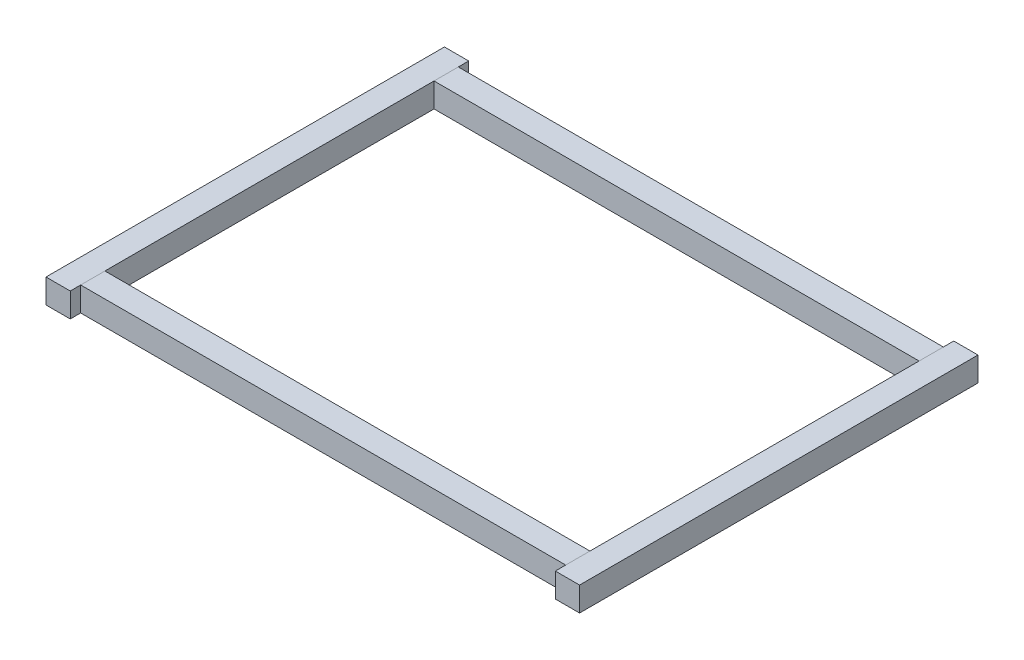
from build123d import *

# Parameters (mm, degrees)
ESQUISSE1_W          = 14
ESQUISSE1_H          = 14
BOSS_EXTRU_1_DEPTH   = 230
BOSS_EXTRU_1_2_DEPTH = 230
BOSS_EXTRU_2_REACH   = 375.54
ESQUISSE2_W          = 14
ESQUISSE2_H          = 14


with BuildPart() as part:
    # Esquisse1 → Boss.-Extru.1 (new body)
    with BuildSketch(Plane.XY):
        with Locations((287, 7)):
            Rectangle(ESQUISSE1_W, ESQUISSE1_H)
    extrude(amount=BOSS_EXTRU_1_DEPTH)


with BuildPart() as body_2:
    # Esquisse1 → Boss.-Extru.1 2 (new body)
    with BuildSketch(Plane.XY):
        with Locations((-7, 7)):
            Rectangle(ESQUISSE1_W, ESQUISSE1_H)
    extrude(amount=BOSS_EXTRU_1_2_DEPTH)


with BuildPart() as body_3:

    # Esquisse2 → Boss.-Extru.2 (new, up to next)
    with BuildSketch(Plane(origin=(0, 0, 0), x_dir=(0, 0, -1), z_dir=(1, 0, 0)), mode=Mode.PRIVATE) as boss_extru_2_sk1:
        with Locations((-13, 7)):
            Rectangle(ESQUISSE2_W, ESQUISSE2_H)
    boss_extru_2_tool1 = extrude(boss_extru_2_sk1.sketch, amount=BOSS_EXTRU_2_REACH, mode=Mode.PRIVATE) - part.part
    # Esquisse2 → Boss.-Extru.2 (new, up to next)
    with BuildSketch(Plane(origin=(0, 0, 0), x_dir=(0, 0, -1), z_dir=(1, 0, 0)), mode=Mode.PRIVATE) as boss_extru_2_sk2:
        with Locations((-217, 7)):
            Rectangle(ESQUISSE2_W, ESQUISSE2_H)
    boss_extru_2_tool2 = extrude(boss_extru_2_sk2.sketch, amount=BOSS_EXTRU_2_REACH, mode=Mode.PRIVATE) - part.part
    add(boss_extru_2_tool1.solids().sort_by_distance((0, 7, 13))[0])
    add(boss_extru_2_tool2.solids().sort_by_distance((0, 7, 217))[0])


solid = Compound([part.part, body_2.part, body_3.part])
